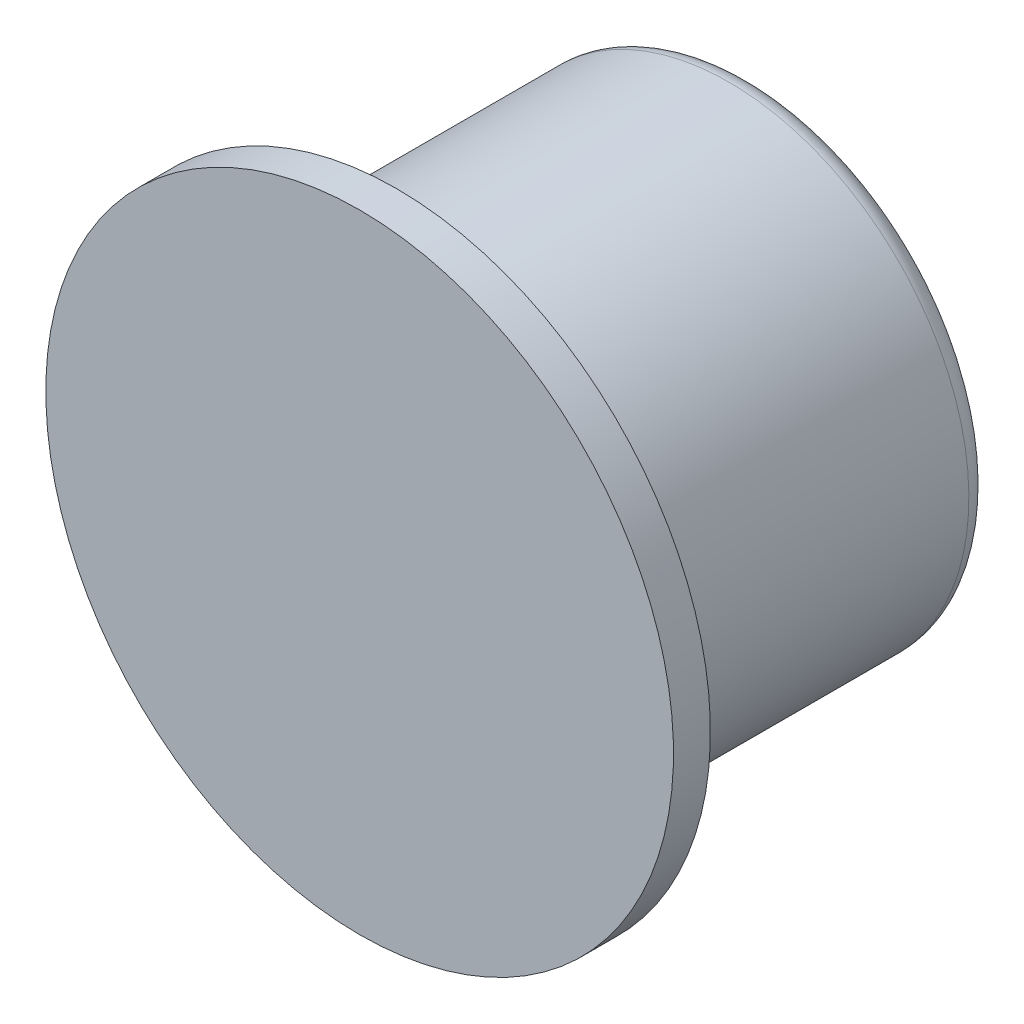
ISO-10303-21;
HEADER;
FILE_DESCRIPTION(('STEP AP214'),'2;1');
FILE_NAME('part.step','',(''),(''),'','','');
FILE_SCHEMA(('AUTOMOTIVE_DESIGN { 1 0 10303 214 1 1 1 1 }'));
ENDSEC;
DATA;
#1=APPLICATION_CONTEXT('core data for automotive mechanical design processes');
#2=APPLICATION_PROTOCOL_DEFINITION('international standard','automotive_design',2000,#1);
#3=PRODUCT_CONTEXT('',#1,'mechanical');
#4=PRODUCT('Part','Part','',(#3));
#5=PRODUCT_RELATED_PRODUCT_CATEGORY('part','',(#4));
#6=PRODUCT_DEFINITION_FORMATION('','',#4);
#7=PRODUCT_DEFINITION_CONTEXT('part definition',#1,'design');
#8=PRODUCT_DEFINITION('design','',#6,#7);
#9=PRODUCT_DEFINITION_SHAPE('','',#8);
#10=(LENGTH_UNIT() NAMED_UNIT(*) SI_UNIT(.MILLI.,.METRE.));
#11=(NAMED_UNIT(*) PLANE_ANGLE_UNIT() SI_UNIT($,.RADIAN.));
#12=(NAMED_UNIT(*) SI_UNIT($,.STERADIAN.) SOLID_ANGLE_UNIT());
#13=UNCERTAINTY_MEASURE_WITH_UNIT(LENGTH_MEASURE(1.E-05),#10,'distance_accuracy_value','');
#14=(GEOMETRIC_REPRESENTATION_CONTEXT(3) GLOBAL_UNCERTAINTY_ASSIGNED_CONTEXT((#13)) GLOBAL_UNIT_ASSIGNED_CONTEXT((#10,
#11,#12)) REPRESENTATION_CONTEXT('',''));
#15=CARTESIAN_POINT('',(0.,0.,0.));
#16=DIRECTION('',(0.,0.,1.));
#17=DIRECTION('',(1.,0.,0.));
#18=AXIS2_PLACEMENT_3D('',#15,#16,#17);
#19=CARTESIAN_POINT('',(0.,0.,0.));
#20=DIRECTION('',(0.,0.,-1.));
#21=DIRECTION('',(0.,1.,0.));
#22=AXIS2_PLACEMENT_3D('',#19,#20,#21);
#23=PLANE('',#22);
#24=CARTESIAN_POINT('',(0.,0.,0.));
#25=DIRECTION('',(0.,0.,1.));
#26=DIRECTION('',(0.,-1.,0.));
#27=AXIS2_PLACEMENT_3D('',#24,#25,#26);
#28=CIRCLE('',#27,42.5);
#29=CARTESIAN_POINT('',(0.,-42.5,0.));
#30=VERTEX_POINT('',#29);
#31=EDGE_CURVE('E11',#30,#30,#28,.T.);
#32=ORIENTED_EDGE('',*,*,#31,.T.);
#33=EDGE_LOOP('',(#32));
#34=FACE_BOUND('',#33,.T.);
#35=ADVANCED_FACE('F32',(#34),#23,.F.);
#36=CARTESIAN_POINT('',(0.,0.,0.));
#37=DIRECTION('',(0.,0.,1.));
#38=DIRECTION('',(0.,-1.,0.));
#39=AXIS2_PLACEMENT_3D('',#36,#37,#38);
#40=CYLINDRICAL_SURFACE('',#39,42.5);
#41=ORIENTED_EDGE('',*,*,#31,.F.);
#42=EDGE_LOOP('',(#41));
#43=FACE_BOUND('',#42,.T.);
#44=CARTESIAN_POINT('',(0.,0.,-5.));
#45=DIRECTION('',(0.,0.,1.));
#46=DIRECTION('',(0.,-1.,0.));
#47=AXIS2_PLACEMENT_3D('',#44,#45,#46);
#48=CIRCLE('',#47,42.5);
#49=CARTESIAN_POINT('',(0.,-42.5,-5.));
#50=VERTEX_POINT('',#49);
#51=EDGE_CURVE('E38',#50,#50,#48,.T.);
#52=ORIENTED_EDGE('',*,*,#51,.T.);
#53=EDGE_LOOP('',(#52));
#54=FACE_BOUND('',#53,.T.);
#55=ADVANCED_FACE('F54',(#43,#54),#40,.T.);
#56=CARTESIAN_POINT('',(0.,42.5,-5.));
#57=DIRECTION('',(0.,0.,1.));
#58=DIRECTION('',(0.,-1.,0.));
#59=AXIS2_PLACEMENT_3D('',#56,#57,#58);
#60=PLANE('',#59);
#61=ORIENTED_EDGE('',*,*,#51,.F.);
#62=EDGE_LOOP('',(#61));
#63=FACE_BOUND('',#62,.T.);
#64=CARTESIAN_POINT('',(0.,0.,-5.));
#65=DIRECTION('',(0.,0.,1.));
#66=DIRECTION('',(0.,-1.,0.));
#67=AXIS2_PLACEMENT_3D('',#64,#65,#66);
#68=CIRCLE('',#67,32.5);
#69=CARTESIAN_POINT('',(0.,-32.5,-5.));
#70=VERTEX_POINT('',#69);
#71=EDGE_CURVE('E66',#70,#70,#68,.T.);
#72=ORIENTED_EDGE('',*,*,#71,.T.);
#73=EDGE_LOOP('',(#72));
#74=FACE_BOUND('',#73,.T.);
#75=ADVANCED_FACE('F59',(#63,#74),#60,.F.);
#76=CARTESIAN_POINT('',(0.,0.,0.));
#77=DIRECTION('',(0.,0.,1.));
#78=DIRECTION('',(0.,-1.,0.));
#79=AXIS2_PLACEMENT_3D('',#76,#77,#78);
#80=CYLINDRICAL_SURFACE('',#79,32.5);
#81=ORIENTED_EDGE('',*,*,#71,.F.);
#82=EDGE_LOOP('',(#81));
#83=FACE_BOUND('',#82,.T.);
#84=CARTESIAN_POINT('',(0.,0.,-50.));
#85=DIRECTION('',(0.,0.,1.));
#86=DIRECTION('',(0.,-1.,0.));
#87=AXIS2_PLACEMENT_3D('',#84,#85,#86);
#88=CIRCLE('',#87,32.5);
#89=CARTESIAN_POINT('',(0.,-32.5,-50.));
#90=VERTEX_POINT('',#89);
#91=EDGE_CURVE('E68',#90,#90,#88,.T.);
#92=ORIENTED_EDGE('',*,*,#91,.T.);
#93=EDGE_LOOP('',(#92));
#94=FACE_BOUND('',#93,.T.);
#95=ADVANCED_FACE('F101',(#83,#94),#80,.T.);
#96=CARTESIAN_POINT('',(0.,0.,-50.));
#97=DIRECTION('',(0.,0.,1.));
#98=DIRECTION('',(0.,-1.,0.));
#99=AXIS2_PLACEMENT_3D('',#96,#97,#98);
#100=TOROIDAL_SURFACE('',#99,29.5,3.);
#101=ORIENTED_EDGE('',*,*,#91,.F.);
#102=EDGE_LOOP('',(#101));
#103=FACE_BOUND('',#102,.T.);
#104=CARTESIAN_POINT('',(0.,0.,-53.));
#105=DIRECTION('',(0.,0.,1.));
#106=DIRECTION('',(0.,-1.,0.));
#107=AXIS2_PLACEMENT_3D('',#104,#105,#106);
#108=CIRCLE('',#107,29.5);
#109=CARTESIAN_POINT('',(0.,-29.5,-53.));
#110=VERTEX_POINT('',#109);
#111=EDGE_CURVE('E73',#110,#110,#108,.T.);
#112=ORIENTED_EDGE('',*,*,#111,.T.);
#113=EDGE_LOOP('',(#112));
#114=FACE_BOUND('',#113,.T.);
#115=ADVANCED_FACE('F94',(#103,#114),#100,.T.);
#116=CARTESIAN_POINT('',(0.,29.5,-53.));
#117=DIRECTION('',(0.,0.,1.));
#118=DIRECTION('',(0.,-1.,0.));
#119=AXIS2_PLACEMENT_3D('',#116,#117,#118);
#120=PLANE('',#119);
#121=ORIENTED_EDGE('',*,*,#111,.F.);
#122=EDGE_LOOP('',(#121));
#123=FACE_BOUND('',#122,.T.);
#124=CARTESIAN_POINT('',(0.,0.,-53.));
#125=DIRECTION('',(0.,0.,1.));
#126=DIRECTION('',(0.,-1.,0.));
#127=AXIS2_PLACEMENT_3D('',#124,#125,#126);
#128=CIRCLE('',#127,4.49999999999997);
#129=CARTESIAN_POINT('',(0.,-4.49999999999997,-53.));
#130=VERTEX_POINT('',#129);
#131=EDGE_CURVE('E76',#130,#130,#128,.T.);
#132=ORIENTED_EDGE('',*,*,#131,.T.);
#133=EDGE_LOOP('',(#132));
#134=FACE_BOUND('',#133,.T.);
#135=ADVANCED_FACE('F88',(#123,#134),#120,.F.);
#136=CARTESIAN_POINT('',(0.,0.,-52.5));
#137=DIRECTION('',(0.,0.,-1.));
#138=DIRECTION('',(0.,1.,0.));
#139=AXIS2_PLACEMENT_3D('',#136,#137,#138);
#140=CONICAL_SURFACE('',#139,3.99999999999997,0.785398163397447);
#141=ORIENTED_EDGE('',*,*,#131,.F.);
#142=EDGE_LOOP('',(#141));
#143=FACE_BOUND('',#142,.T.);
#144=CARTESIAN_POINT('',(0.,0.,-52.5));
#145=DIRECTION('',(0.,0.,1.));
#146=DIRECTION('',(0.,-1.,0.));
#147=AXIS2_PLACEMENT_3D('',#144,#145,#146);
#148=CIRCLE('',#147,3.99999999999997);
#149=CARTESIAN_POINT('',(0.,-3.99999999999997,-52.5));
#150=VERTEX_POINT('',#149);
#151=EDGE_CURVE('E79',#150,#150,#148,.T.);
#152=ORIENTED_EDGE('',*,*,#151,.T.);
#153=EDGE_LOOP('',(#152));
#154=FACE_BOUND('',#153,.T.);
#155=ADVANCED_FACE('F49',(#143,#154),#140,.F.);
#156=CARTESIAN_POINT('',(0.,0.,0.));
#157=DIRECTION('',(0.,0.,1.));
#158=DIRECTION('',(0.,-1.,0.));
#159=AXIS2_PLACEMENT_3D('',#156,#157,#158);
#160=CYLINDRICAL_SURFACE('',#159,3.99999999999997);
#161=ORIENTED_EDGE('',*,*,#151,.F.);
#162=EDGE_LOOP('',(#161));
#163=FACE_BOUND('',#162,.T.);
#164=CARTESIAN_POINT('',(0.,0.,-44.));
#165=DIRECTION('',(0.,0.,1.));
#166=DIRECTION('',(0.,-1.,0.));
#167=AXIS2_PLACEMENT_3D('',#164,#165,#166);
#168=CIRCLE('',#167,3.99999999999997);
#169=CARTESIAN_POINT('',(0.,-3.99999999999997,-44.));
#170=VERTEX_POINT('',#169);
#171=EDGE_CURVE('E82',#170,#170,#168,.T.);
#172=ORIENTED_EDGE('',*,*,#171,.T.);
#173=EDGE_LOOP('',(#172));
#174=FACE_BOUND('',#173,.T.);
#175=ADVANCED_FACE('F43',(#163,#174),#160,.F.);
#176=CARTESIAN_POINT('',(0.,0.,-41.6905989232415));
#177=DIRECTION('',(0.,0.,-1.));
#178=DIRECTION('',(0.,1.,0.));
#179=AXIS2_PLACEMENT_3D('',#176,#177,#178);
#180=CONICAL_SURFACE('',#179,0.,1.04719755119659);
#181=ORIENTED_EDGE('',*,*,#171,.F.);
#182=EDGE_LOOP('',(#181));
#183=FACE_BOUND('',#182,.T.);
#184=CARTESIAN_POINT('',(0.,0.,-41.6905989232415));
#185=VERTEX_POINT('',#184);
#186=VERTEX_LOOP('',#185);
#187=FACE_BOUND('',#186,.T.);
#188=ADVANCED_FACE('F41',(#183,#187),#180,.F.);
#189=CLOSED_SHELL('',(#35,#55,#75,#95,#115,#135,#155,#175,#188));
#190=MANIFOLD_SOLID_BREP('B2',#189);
#191=ADVANCED_BREP_SHAPE_REPRESENTATION('',(#18,#190),#14);
#192=SHAPE_DEFINITION_REPRESENTATION(#9,#191);
ENDSEC;
END-ISO-10303-21;
